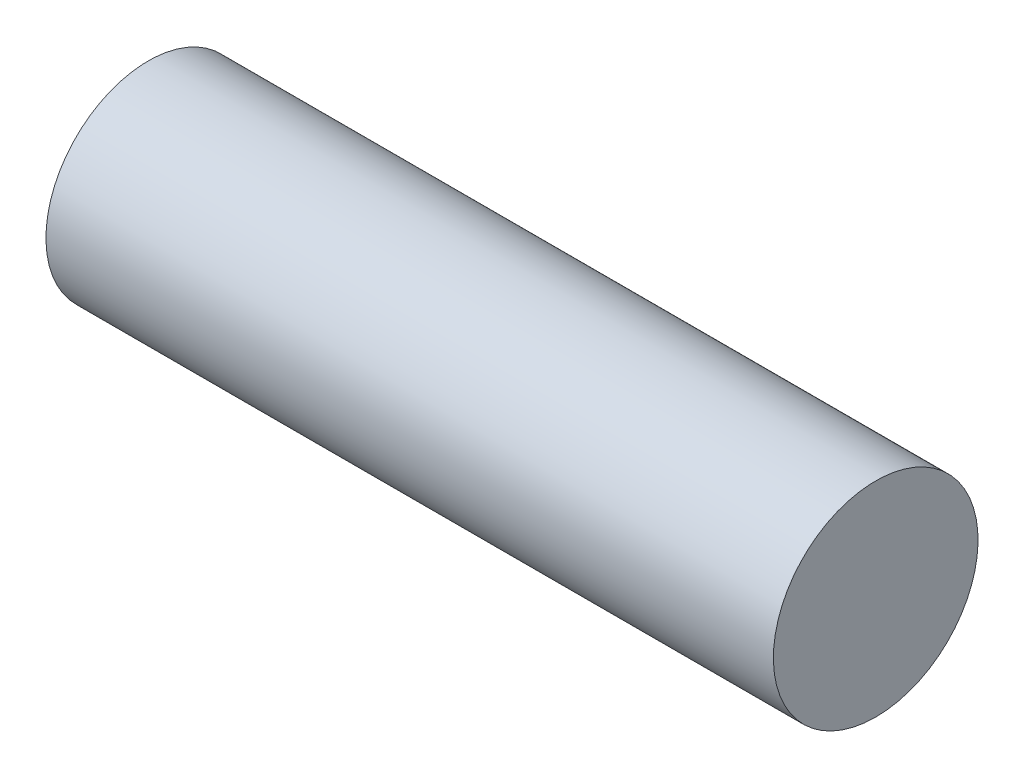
ISO-10303-21;
HEADER;
FILE_DESCRIPTION(('STEP AP214'),'2;1');
FILE_NAME('part.step','',(''),(''),'','','');
FILE_SCHEMA(('AUTOMOTIVE_DESIGN { 1 0 10303 214 1 1 1 1 }'));
ENDSEC;
DATA;
#1=APPLICATION_CONTEXT('core data for automotive mechanical design processes');
#2=APPLICATION_PROTOCOL_DEFINITION('international standard','automotive_design',2000,#1);
#3=PRODUCT_CONTEXT('',#1,'mechanical');
#4=PRODUCT('Part','Part','',(#3));
#5=PRODUCT_RELATED_PRODUCT_CATEGORY('part','',(#4));
#6=PRODUCT_DEFINITION_FORMATION('','',#4);
#7=PRODUCT_DEFINITION_CONTEXT('part definition',#1,'design');
#8=PRODUCT_DEFINITION('design','',#6,#7);
#9=PRODUCT_DEFINITION_SHAPE('','',#8);
#10=(LENGTH_UNIT() NAMED_UNIT(*) SI_UNIT(.MILLI.,.METRE.));
#11=(NAMED_UNIT(*) PLANE_ANGLE_UNIT() SI_UNIT($,.RADIAN.));
#12=(NAMED_UNIT(*) SI_UNIT($,.STERADIAN.) SOLID_ANGLE_UNIT());
#13=UNCERTAINTY_MEASURE_WITH_UNIT(LENGTH_MEASURE(1.E-05),#10,'distance_accuracy_value','');
#14=(GEOMETRIC_REPRESENTATION_CONTEXT(3) GLOBAL_UNCERTAINTY_ASSIGNED_CONTEXT((#13)) GLOBAL_UNIT_ASSIGNED_CONTEXT((#10,
#11,#12)) REPRESENTATION_CONTEXT('',''));
#15=CARTESIAN_POINT('',(0.,0.,0.));
#16=DIRECTION('',(0.,0.,1.));
#17=DIRECTION('',(1.,0.,0.));
#18=AXIS2_PLACEMENT_3D('',#15,#16,#17);
#19=CARTESIAN_POINT('',(0.,0.,0.));
#20=DIRECTION('',(1.,0.,0.));
#21=DIRECTION('',(0.,1.,0.));
#22=AXIS2_PLACEMENT_3D('',#19,#20,#21);
#23=PLANE('',#22);
#24=CARTESIAN_POINT('',(0.,0.,0.));
#25=DIRECTION('',(-1.,0.,0.));
#26=DIRECTION('',(0.,-1.,0.));
#27=AXIS2_PLACEMENT_3D('',#24,#25,#26);
#28=CIRCLE('',#27,8.12799999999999);
#29=CARTESIAN_POINT('',(0.,-8.12799999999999,0.));
#30=VERTEX_POINT('',#29);
#31=EDGE_CURVE('E10',#30,#30,#28,.T.);
#32=ORIENTED_EDGE('',*,*,#31,.T.);
#33=EDGE_LOOP('',(#32));
#34=FACE_BOUND('',#33,.T.);
#35=ADVANCED_FACE('F31',(#34),#23,.F.);
#36=CARTESIAN_POINT('',(57.785,0.,0.));
#37=DIRECTION('',(-1.,0.,0.));
#38=DIRECTION('',(0.,-1.,0.));
#39=AXIS2_PLACEMENT_3D('',#36,#37,#38);
#40=CYLINDRICAL_SURFACE('',#39,8.12799999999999);
#41=ORIENTED_EDGE('',*,*,#31,.F.);
#42=EDGE_LOOP('',(#41));
#43=FACE_BOUND('',#42,.T.);
#44=CARTESIAN_POINT('',(57.785,0.,0.));
#45=DIRECTION('',(-1.,0.,0.));
#46=DIRECTION('',(0.,-1.,0.));
#47=AXIS2_PLACEMENT_3D('',#44,#45,#46);
#48=CIRCLE('',#47,8.12799999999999);
#49=CARTESIAN_POINT('',(57.785,-8.12799999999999,0.));
#50=VERTEX_POINT('',#49);
#51=EDGE_CURVE('E37',#50,#50,#48,.T.);
#52=ORIENTED_EDGE('',*,*,#51,.T.);
#53=EDGE_LOOP('',(#52));
#54=FACE_BOUND('',#53,.T.);
#55=ADVANCED_FACE('F43',(#43,#54),#40,.T.);
#56=CARTESIAN_POINT('',(57.785,8.12799999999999,0.));
#57=DIRECTION('',(-1.,0.,0.));
#58=DIRECTION('',(0.,-1.,0.));
#59=AXIS2_PLACEMENT_3D('',#56,#57,#58);
#60=PLANE('',#59);
#61=ORIENTED_EDGE('',*,*,#51,.F.);
#62=EDGE_LOOP('',(#61));
#63=FACE_BOUND('',#62,.T.);
#64=ADVANCED_FACE('F45',(#63),#60,.F.);
#65=CLOSED_SHELL('',(#35,#55,#64));
#66=MANIFOLD_SOLID_BREP('B2',#65);
#67=ADVANCED_BREP_SHAPE_REPRESENTATION('',(#18,#66),#14);
#68=SHAPE_DEFINITION_REPRESENTATION(#9,#67);
ENDSEC;
END-ISO-10303-21;
